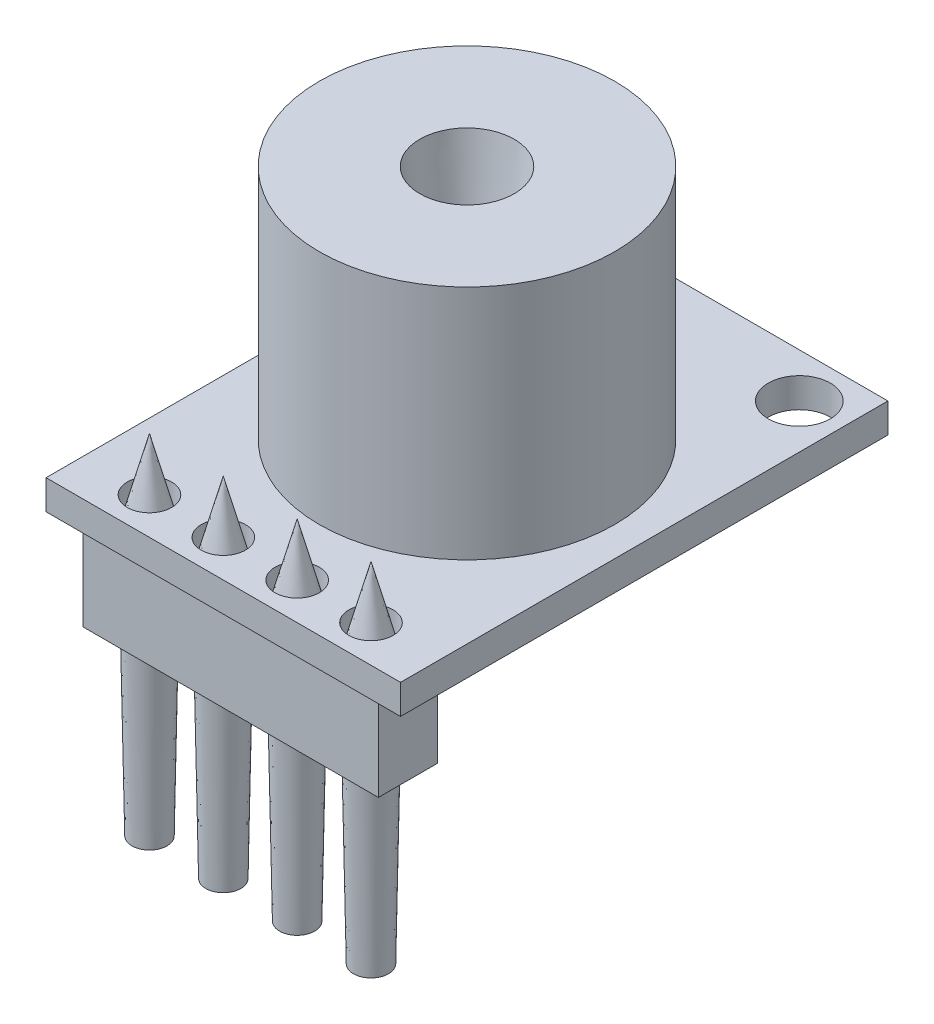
ISO-10303-21;
HEADER;
FILE_DESCRIPTION(('STEP AP214'),'2;1');
FILE_NAME('part.step','',(''),(''),'','','');
FILE_SCHEMA(('AUTOMOTIVE_DESIGN { 1 0 10303 214 1 1 1 1 }'));
ENDSEC;
DATA;
#1=APPLICATION_CONTEXT('core data for automotive mechanical design processes');
#2=APPLICATION_PROTOCOL_DEFINITION('international standard','automotive_design',2000,#1);
#3=PRODUCT_CONTEXT('',#1,'mechanical');
#4=PRODUCT('Part','Part','',(#3));
#5=PRODUCT_RELATED_PRODUCT_CATEGORY('part','',(#4));
#6=PRODUCT_DEFINITION_FORMATION('','',#4);
#7=PRODUCT_DEFINITION_CONTEXT('part definition',#1,'design');
#8=PRODUCT_DEFINITION('design','',#6,#7);
#9=PRODUCT_DEFINITION_SHAPE('','',#8);
#10=(LENGTH_UNIT() NAMED_UNIT(*) SI_UNIT(.MILLI.,.METRE.));
#11=(NAMED_UNIT(*) PLANE_ANGLE_UNIT() SI_UNIT($,.RADIAN.));
#12=(NAMED_UNIT(*) SI_UNIT($,.STERADIAN.) SOLID_ANGLE_UNIT());
#13=UNCERTAINTY_MEASURE_WITH_UNIT(LENGTH_MEASURE(1.E-05),#10,'distance_accuracy_value','');
#14=(GEOMETRIC_REPRESENTATION_CONTEXT(3) GLOBAL_UNCERTAINTY_ASSIGNED_CONTEXT((#13)) GLOBAL_UNIT_ASSIGNED_CONTEXT((#10,
#11,#12)) REPRESENTATION_CONTEXT('',''));
#15=CARTESIAN_POINT('',(0.,0.,0.));
#16=DIRECTION('',(0.,0.,1.));
#17=DIRECTION('',(1.,0.,0.));
#18=AXIS2_PLACEMENT_3D('',#15,#16,#17);
#19=CARTESIAN_POINT('',(3.75,0.,7.));
#20=DIRECTION('',(0.,1.,0.));
#21=DIRECTION('',(0.,0.,1.));
#22=AXIS2_PLACEMENT_3D('',#19,#20,#21);
#23=CONICAL_SURFACE('',#22,0.75,0.0174532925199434);
#24=CARTESIAN_POINT('',(3.75,-9.,7.));
#25=DIRECTION('',(0.,1.,0.));
#26=DIRECTION('',(0.,0.,1.));
#27=AXIS2_PLACEMENT_3D('',#24,#25,#26);
#28=CIRCLE('',#27,0.592904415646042);
#29=CARTESIAN_POINT('',(3.75,-9.,7.59290441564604));
#30=VERTEX_POINT('',#29);
#31=EDGE_CURVE('E55',#30,#30,#28,.T.);
#32=ORIENTED_EDGE('',*,*,#31,.T.);
#33=EDGE_LOOP('',(#32));
#34=FACE_BOUND('',#33,.T.);
#35=CARTESIAN_POINT('',(3.75,0.,7.));
#36=DIRECTION('',(0.,1.,0.));
#37=DIRECTION('',(0.,0.,1.));
#38=AXIS2_PLACEMENT_3D('',#35,#36,#37);
#39=CIRCLE('',#38,0.75);
#40=CARTESIAN_POINT('',(3.75,0.,7.75));
#41=VERTEX_POINT('',#40);
#42=EDGE_CURVE('E11',#41,#41,#39,.T.);
#43=ORIENTED_EDGE('',*,*,#42,.F.);
#44=EDGE_LOOP('',(#43));
#45=FACE_BOUND('',#44,.T.);
#46=ADVANCED_FACE('F48',(#34,#45),#23,.T.);
#47=CARTESIAN_POINT('',(3.75,-9.,7.));
#48=DIRECTION('',(0.,1.,0.));
#49=DIRECTION('',(0.,0.,1.));
#50=AXIS2_PLACEMENT_3D('',#47,#48,#49);
#51=PLANE('',#50);
#52=ORIENTED_EDGE('',*,*,#31,.F.);
#53=EDGE_LOOP('',(#52));
#54=FACE_BOUND('',#53,.T.);
#55=ADVANCED_FACE('F50',(#54),#51,.F.);
#56=CARTESIAN_POINT('',(3.75,0.,7.));
#57=DIRECTION('',(0.,1.,0.));
#58=DIRECTION('',(0.,0.,1.));
#59=AXIS2_PLACEMENT_3D('',#56,#57,#58);
#60=PLANE('',#59);
#61=ORIENTED_EDGE('',*,*,#42,.T.);
#62=EDGE_LOOP('',(#61));
#63=FACE_BOUND('',#62,.T.);
#64=ADVANCED_FACE('F64',(#63),#60,.T.);
#65=CLOSED_SHELL('',(#46,#55,#64));
#66=MANIFOLD_SOLID_BREP('B2',#65);
#67=CARTESIAN_POINT('',(1.25,0.,7.));
#68=DIRECTION('',(0.,1.,0.));
#69=DIRECTION('',(0.,0.,1.));
#70=AXIS2_PLACEMENT_3D('',#67,#68,#69);
#71=CONICAL_SURFACE('',#70,0.750000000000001,0.0174532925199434);
#72=CARTESIAN_POINT('',(1.25,-9.,7.));
#73=DIRECTION('',(0.,1.,0.));
#74=DIRECTION('',(0.,0.,1.));
#75=AXIS2_PLACEMENT_3D('',#72,#73,#74);
#76=CIRCLE('',#75,0.592904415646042);
#77=CARTESIAN_POINT('',(1.25,-9.,7.59290441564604));
#78=VERTEX_POINT('',#77);
#79=EDGE_CURVE('E110',#78,#78,#76,.T.);
#80=ORIENTED_EDGE('',*,*,#79,.T.);
#81=EDGE_LOOP('',(#80));
#82=FACE_BOUND('',#81,.T.);
#83=CARTESIAN_POINT('',(1.25,0.,7.));
#84=DIRECTION('',(0.,1.,0.));
#85=DIRECTION('',(0.,0.,1.));
#86=AXIS2_PLACEMENT_3D('',#83,#84,#85);
#87=CIRCLE('',#86,0.750000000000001);
#88=CARTESIAN_POINT('',(1.25,0.,7.75));
#89=VERTEX_POINT('',#88);
#90=EDGE_CURVE('E47',#89,#89,#87,.T.);
#91=ORIENTED_EDGE('',*,*,#90,.F.);
#92=EDGE_LOOP('',(#91));
#93=FACE_BOUND('',#92,.T.);
#94=ADVANCED_FACE('F103',(#82,#93),#71,.T.);
#95=CARTESIAN_POINT('',(1.25,-9.,7.));
#96=DIRECTION('',(0.,1.,0.));
#97=DIRECTION('',(0.,0.,1.));
#98=AXIS2_PLACEMENT_3D('',#95,#96,#97);
#99=PLANE('',#98);
#100=ORIENTED_EDGE('',*,*,#79,.F.);
#101=EDGE_LOOP('',(#100));
#102=FACE_BOUND('',#101,.T.);
#103=ADVANCED_FACE('F105',(#102),#99,.F.);
#104=CARTESIAN_POINT('',(1.25,0.,7.));
#105=DIRECTION('',(0.,1.,0.));
#106=DIRECTION('',(0.,0.,1.));
#107=AXIS2_PLACEMENT_3D('',#104,#105,#106);
#108=PLANE('',#107);
#109=ORIENTED_EDGE('',*,*,#90,.T.);
#110=EDGE_LOOP('',(#109));
#111=FACE_BOUND('',#110,.T.);
#112=ADVANCED_FACE('F119',(#111),#108,.T.);
#113=CLOSED_SHELL('',(#94,#103,#112));
#114=MANIFOLD_SOLID_BREP('B6',#113);
#115=CARTESIAN_POINT('',(-1.25,0.,7.));
#116=DIRECTION('',(0.,1.,0.));
#117=DIRECTION('',(0.,0.,1.));
#118=AXIS2_PLACEMENT_3D('',#115,#116,#117);
#119=CONICAL_SURFACE('',#118,0.750000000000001,0.0174532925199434);
#120=CARTESIAN_POINT('',(-1.25,-9.,7.));
#121=DIRECTION('',(0.,1.,0.));
#122=DIRECTION('',(0.,0.,1.));
#123=AXIS2_PLACEMENT_3D('',#120,#121,#122);
#124=CIRCLE('',#123,0.592904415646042);
#125=CARTESIAN_POINT('',(-1.25,-9.,7.59290441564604));
#126=VERTEX_POINT('',#125);
#127=EDGE_CURVE('E165',#126,#126,#124,.T.);
#128=ORIENTED_EDGE('',*,*,#127,.T.);
#129=EDGE_LOOP('',(#128));
#130=FACE_BOUND('',#129,.T.);
#131=CARTESIAN_POINT('',(-1.25,0.,7.));
#132=DIRECTION('',(0.,1.,0.));
#133=DIRECTION('',(0.,0.,1.));
#134=AXIS2_PLACEMENT_3D('',#131,#132,#133);
#135=CIRCLE('',#134,0.750000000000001);
#136=CARTESIAN_POINT('',(-1.25,0.,7.75));
#137=VERTEX_POINT('',#136);
#138=EDGE_CURVE('E102',#137,#137,#135,.T.);
#139=ORIENTED_EDGE('',*,*,#138,.F.);
#140=EDGE_LOOP('',(#139));
#141=FACE_BOUND('',#140,.T.);
#142=ADVANCED_FACE('F158',(#130,#141),#119,.T.);
#143=CARTESIAN_POINT('',(-1.25,-9.,7.));
#144=DIRECTION('',(0.,1.,0.));
#145=DIRECTION('',(0.,0.,1.));
#146=AXIS2_PLACEMENT_3D('',#143,#144,#145);
#147=PLANE('',#146);
#148=ORIENTED_EDGE('',*,*,#127,.F.);
#149=EDGE_LOOP('',(#148));
#150=FACE_BOUND('',#149,.T.);
#151=ADVANCED_FACE('F160',(#150),#147,.F.);
#152=CARTESIAN_POINT('',(-1.25,0.,7.));
#153=DIRECTION('',(0.,1.,0.));
#154=DIRECTION('',(0.,0.,1.));
#155=AXIS2_PLACEMENT_3D('',#152,#153,#154);
#156=PLANE('',#155);
#157=ORIENTED_EDGE('',*,*,#138,.T.);
#158=EDGE_LOOP('',(#157));
#159=FACE_BOUND('',#158,.T.);
#160=ADVANCED_FACE('F174',(#159),#156,.T.);
#161=CLOSED_SHELL('',(#142,#151,#160));
#162=MANIFOLD_SOLID_BREP('B42',#161);
#163=CARTESIAN_POINT('',(-3.75,0.,7.));
#164=DIRECTION('',(0.,1.,0.));
#165=DIRECTION('',(0.,0.,1.));
#166=AXIS2_PLACEMENT_3D('',#163,#164,#165);
#167=CONICAL_SURFACE('',#166,0.750000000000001,0.0174532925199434);
#168=CARTESIAN_POINT('',(-3.75,-9.,7.));
#169=DIRECTION('',(0.,1.,0.));
#170=DIRECTION('',(0.,0.,1.));
#171=AXIS2_PLACEMENT_3D('',#168,#169,#170);
#172=CIRCLE('',#171,0.592904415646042);
#173=CARTESIAN_POINT('',(-3.75,-9.,7.59290441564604));
#174=VERTEX_POINT('',#173);
#175=EDGE_CURVE('E157',#174,#174,#172,.T.);
#176=ORIENTED_EDGE('',*,*,#175,.T.);
#177=EDGE_LOOP('',(#176));
#178=FACE_BOUND('',#177,.T.);
#179=CARTESIAN_POINT('',(-3.75,0.,7.));
#180=DIRECTION('',(0.,1.,0.));
#181=DIRECTION('',(0.,0.,1.));
#182=AXIS2_PLACEMENT_3D('',#179,#180,#181);
#183=CIRCLE('',#182,0.750000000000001);
#184=CARTESIAN_POINT('',(-3.75,0.,7.75));
#185=VERTEX_POINT('',#184);
#186=EDGE_CURVE('E221',#185,#185,#183,.T.);
#187=ORIENTED_EDGE('',*,*,#186,.F.);
#188=EDGE_LOOP('',(#187));
#189=FACE_BOUND('',#188,.T.);
#190=ADVANCED_FACE('F215',(#178,#189),#167,.T.);
#191=CARTESIAN_POINT('',(-3.75,-9.,7.));
#192=DIRECTION('',(0.,1.,0.));
#193=DIRECTION('',(0.,0.,1.));
#194=AXIS2_PLACEMENT_3D('',#191,#192,#193);
#195=PLANE('',#194);
#196=ORIENTED_EDGE('',*,*,#175,.F.);
#197=EDGE_LOOP('',(#196));
#198=FACE_BOUND('',#197,.T.);
#199=ADVANCED_FACE('F230',(#198),#195,.F.);
#200=CARTESIAN_POINT('',(-3.75,0.,7.));
#201=DIRECTION('',(0.,1.,0.));
#202=DIRECTION('',(0.,0.,1.));
#203=AXIS2_PLACEMENT_3D('',#200,#201,#202);
#204=PLANE('',#203);
#205=ORIENTED_EDGE('',*,*,#186,.T.);
#206=EDGE_LOOP('',(#205));
#207=FACE_BOUND('',#206,.T.);
#208=ADVANCED_FACE('F227',(#207),#204,.T.);
#209=CLOSED_SHELL('',(#190,#199,#208));
#210=MANIFOLD_SOLID_BREP('B97',#209);
#211=CARTESIAN_POINT('',(5.,-3.,6.));
#212=DIRECTION('',(1.,0.,0.));
#213=DIRECTION('',(0.,0.,-1.));
#214=AXIS2_PLACEMENT_3D('',#211,#212,#213);
#215=PLANE('',#214);
#216=DIRECTION('',(0.,0.,-1.));
#217=VECTOR('',#216,1.);
#218=CARTESIAN_POINT('',(5.,0.,6.));
#219=LINE('',#218,#217);
#220=CARTESIAN_POINT('',(5.,0.,8.));
#221=VERTEX_POINT('',#220);
#222=CARTESIAN_POINT('',(5.,0.,6.));
#223=VERTEX_POINT('',#222);
#224=EDGE_CURVE('E336',#221,#223,#219,.T.);
#225=ORIENTED_EDGE('',*,*,#224,.F.);
#226=DIRECTION('',(0.,1.,0.));
#227=VECTOR('',#226,1.);
#228=CARTESIAN_POINT('',(5.,-3.,8.));
#229=LINE('',#228,#227);
#230=CARTESIAN_POINT('',(5.,-3.,8.));
#231=VERTEX_POINT('',#230);
#232=EDGE_CURVE('E213',#231,#221,#229,.T.);
#233=ORIENTED_EDGE('',*,*,#232,.F.);
#234=DIRECTION('',(0.,0.,-1.));
#235=VECTOR('',#234,1.);
#236=CARTESIAN_POINT('',(5.,-3.,6.));
#237=LINE('',#236,#235);
#238=CARTESIAN_POINT('',(5.,-3.,6.));
#239=VERTEX_POINT('',#238);
#240=EDGE_CURVE('E330',#231,#239,#237,.T.);
#241=ORIENTED_EDGE('',*,*,#240,.T.);
#242=DIRECTION('',(0.,1.,0.));
#243=VECTOR('',#242,1.);
#244=CARTESIAN_POINT('',(5.,-3.,6.));
#245=LINE('',#244,#243);
#246=EDGE_CURVE('E275',#239,#223,#245,.T.);
#247=ORIENTED_EDGE('',*,*,#246,.T.);
#248=EDGE_LOOP('',(#225,#233,#241,#247));
#249=FACE_BOUND('',#248,.T.);
#250=ADVANCED_FACE('F272',(#249),#215,.T.);
#251=CARTESIAN_POINT('',(-5.,-3.,8.));
#252=DIRECTION('',(0.,0.,1.));
#253=DIRECTION('',(1.,0.,0.));
#254=AXIS2_PLACEMENT_3D('',#251,#252,#253);
#255=PLANE('',#254);
#256=DIRECTION('',(1.,0.,0.));
#257=VECTOR('',#256,1.);
#258=CARTESIAN_POINT('',(-5.,0.,8.));
#259=LINE('',#258,#257);
#260=CARTESIAN_POINT('',(-5.,0.,8.));
#261=VERTEX_POINT('',#260);
#262=EDGE_CURVE('E332',#261,#221,#259,.T.);
#263=ORIENTED_EDGE('',*,*,#262,.F.);
#264=DIRECTION('',(0.,1.,0.));
#265=VECTOR('',#264,1.);
#266=CARTESIAN_POINT('',(-5.,-3.,8.));
#267=LINE('',#266,#265);
#268=CARTESIAN_POINT('',(-5.,-3.,8.));
#269=VERTEX_POINT('',#268);
#270=EDGE_CURVE('E281',#269,#261,#267,.T.);
#271=ORIENTED_EDGE('',*,*,#270,.F.);
#272=DIRECTION('',(1.,0.,0.));
#273=VECTOR('',#272,1.);
#274=CARTESIAN_POINT('',(-5.,-3.,8.));
#275=LINE('',#274,#273);
#276=EDGE_CURVE('E327',#269,#231,#275,.T.);
#277=ORIENTED_EDGE('',*,*,#276,.T.);
#278=ORIENTED_EDGE('',*,*,#232,.T.);
#279=EDGE_LOOP('',(#263,#271,#277,#278));
#280=FACE_BOUND('',#279,.T.);
#281=ADVANCED_FACE('F346',(#280),#255,.T.);
#282=CARTESIAN_POINT('',(-5.,-3.,6.));
#283=DIRECTION('',(-1.,0.,0.));
#284=DIRECTION('',(0.,0.,1.));
#285=AXIS2_PLACEMENT_3D('',#282,#283,#284);
#286=PLANE('',#285);
#287=DIRECTION('',(0.,0.,1.));
#288=VECTOR('',#287,1.);
#289=CARTESIAN_POINT('',(-5.,0.,6.));
#290=LINE('',#289,#288);
#291=CARTESIAN_POINT('',(-5.,0.,6.));
#292=VERTEX_POINT('',#291);
#293=EDGE_CURVE('E322',#292,#261,#290,.T.);
#294=ORIENTED_EDGE('',*,*,#293,.F.);
#295=DIRECTION('',(0.,1.,0.));
#296=VECTOR('',#295,1.);
#297=CARTESIAN_POINT('',(-5.,-3.,6.));
#298=LINE('',#297,#296);
#299=CARTESIAN_POINT('',(-5.,-3.,6.));
#300=VERTEX_POINT('',#299);
#301=EDGE_CURVE('E317',#300,#292,#298,.T.);
#302=ORIENTED_EDGE('',*,*,#301,.F.);
#303=DIRECTION('',(0.,0.,1.));
#304=VECTOR('',#303,1.);
#305=CARTESIAN_POINT('',(-5.,-3.,6.));
#306=LINE('',#305,#304);
#307=EDGE_CURVE('E320',#300,#269,#306,.T.);
#308=ORIENTED_EDGE('',*,*,#307,.T.);
#309=ORIENTED_EDGE('',*,*,#270,.T.);
#310=EDGE_LOOP('',(#294,#302,#308,#309));
#311=FACE_BOUND('',#310,.T.);
#312=ADVANCED_FACE('F319',(#311),#286,.T.);
#313=CARTESIAN_POINT('',(-5.,-3.,6.));
#314=DIRECTION('',(0.,0.,-1.));
#315=DIRECTION('',(-1.,0.,0.));
#316=AXIS2_PLACEMENT_3D('',#313,#314,#315);
#317=PLANE('',#316);
#318=DIRECTION('',(-1.,0.,0.));
#319=VECTOR('',#318,1.);
#320=CARTESIAN_POINT('',(-5.,0.,6.));
#321=LINE('',#320,#319);
#322=EDGE_CURVE('E339',#223,#292,#321,.T.);
#323=ORIENTED_EDGE('',*,*,#322,.F.);
#324=ORIENTED_EDGE('',*,*,#246,.F.);
#325=DIRECTION('',(-1.,0.,0.));
#326=VECTOR('',#325,1.);
#327=CARTESIAN_POINT('',(-5.,-3.,6.));
#328=LINE('',#327,#326);
#329=EDGE_CURVE('E326',#239,#300,#328,.T.);
#330=ORIENTED_EDGE('',*,*,#329,.T.);
#331=ORIENTED_EDGE('',*,*,#301,.T.);
#332=EDGE_LOOP('',(#323,#324,#330,#331));
#333=FACE_BOUND('',#332,.T.);
#334=ADVANCED_FACE('F329',(#333),#317,.T.);
#335=CARTESIAN_POINT('',(0.,-3.,0.));
#336=DIRECTION('',(0.,1.,0.));
#337=DIRECTION('',(0.,0.,1.));
#338=AXIS2_PLACEMENT_3D('',#335,#336,#337);
#339=PLANE('',#338);
#340=ORIENTED_EDGE('',*,*,#240,.F.);
#341=ORIENTED_EDGE('',*,*,#276,.F.);
#342=ORIENTED_EDGE('',*,*,#307,.F.);
#343=ORIENTED_EDGE('',*,*,#329,.F.);
#344=EDGE_LOOP('',(#340,#341,#342,#343));
#345=FACE_BOUND('',#344,.T.);
#346=ADVANCED_FACE('F325',(#345),#339,.F.);
#347=CARTESIAN_POINT('',(0.,0.,0.));
#348=DIRECTION('',(0.,1.,0.));
#349=DIRECTION('',(0.,0.,1.));
#350=AXIS2_PLACEMENT_3D('',#347,#348,#349);
#351=PLANE('',#350);
#352=ORIENTED_EDGE('',*,*,#224,.T.);
#353=ORIENTED_EDGE('',*,*,#322,.T.);
#354=ORIENTED_EDGE('',*,*,#293,.T.);
#355=ORIENTED_EDGE('',*,*,#262,.T.);
#356=EDGE_LOOP('',(#352,#353,#354,#355));
#357=FACE_BOUND('',#356,.T.);
#358=ADVANCED_FACE('F345',(#357),#351,.T.);
#359=CLOSED_SHELL('',(#250,#281,#312,#334,#346,#358));
#360=MANIFOLD_SOLID_BREP('B152',#359);
#361=CARTESIAN_POINT('',(3.75,0.,7.));
#362=DIRECTION('',(0.,-1.,0.));
#363=DIRECTION('',(0.,0.,1.));
#364=AXIS2_PLACEMENT_3D('',#361,#362,#363);
#365=CONICAL_SURFACE('',#364,0.75,0.261799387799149);
#366=CARTESIAN_POINT('',(3.75,2.79903810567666,7.));
#367=VERTEX_POINT('',#366);
#368=VERTEX_LOOP('',#367);
#369=FACE_BOUND('',#368,.T.);
#370=CARTESIAN_POINT('',(3.75,0.,7.));
#371=DIRECTION('',(0.,1.,0.));
#372=DIRECTION('',(0.,0.,1.));
#373=AXIS2_PLACEMENT_3D('',#370,#371,#372);
#374=CIRCLE('',#373,0.75);
#375=CARTESIAN_POINT('',(3.75,0.,7.75));
#376=VERTEX_POINT('',#375);
#377=EDGE_CURVE('E270',#376,#376,#374,.T.);
#378=ORIENTED_EDGE('',*,*,#377,.T.);
#379=EDGE_LOOP('',(#378));
#380=FACE_BOUND('',#379,.T.);
#381=ADVANCED_FACE('F418',(#369,#380),#365,.T.);
#382=CARTESIAN_POINT('',(3.75,0.,7.));
#383=DIRECTION('',(0.,1.,0.));
#384=DIRECTION('',(0.,0.,1.));
#385=AXIS2_PLACEMENT_3D('',#382,#383,#384);
#386=PLANE('',#385);
#387=ORIENTED_EDGE('',*,*,#377,.F.);
#388=EDGE_LOOP('',(#387));
#389=FACE_BOUND('',#388,.T.);
#390=ADVANCED_FACE('F420',(#389),#386,.F.);
#391=CLOSED_SHELL('',(#381,#390));
#392=MANIFOLD_SOLID_BREP('B207',#391);
#393=CARTESIAN_POINT('',(1.25,0.,7.));
#394=DIRECTION('',(0.,-1.,0.));
#395=DIRECTION('',(0.,0.,1.));
#396=AXIS2_PLACEMENT_3D('',#393,#394,#395);
#397=CONICAL_SURFACE('',#396,0.750000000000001,0.261799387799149);
#398=CARTESIAN_POINT('',(1.25,2.79903810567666,7.));
#399=VERTEX_POINT('',#398);
#400=VERTEX_LOOP('',#399);
#401=FACE_BOUND('',#400,.T.);
#402=CARTESIAN_POINT('',(1.25,0.,7.));
#403=DIRECTION('',(0.,1.,0.));
#404=DIRECTION('',(0.,0.,1.));
#405=AXIS2_PLACEMENT_3D('',#402,#403,#404);
#406=CIRCLE('',#405,0.750000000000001);
#407=CARTESIAN_POINT('',(1.25,0.,7.75));
#408=VERTEX_POINT('',#407);
#409=EDGE_CURVE('E416',#408,#408,#406,.T.);
#410=ORIENTED_EDGE('',*,*,#409,.T.);
#411=EDGE_LOOP('',(#410));
#412=FACE_BOUND('',#411,.T.);
#413=ADVANCED_FACE('F460',(#401,#412),#397,.T.);
#414=CARTESIAN_POINT('',(1.25,0.,7.));
#415=DIRECTION('',(0.,1.,0.));
#416=DIRECTION('',(0.,0.,1.));
#417=AXIS2_PLACEMENT_3D('',#414,#415,#416);
#418=PLANE('',#417);
#419=ORIENTED_EDGE('',*,*,#409,.F.);
#420=EDGE_LOOP('',(#419));
#421=FACE_BOUND('',#420,.T.);
#422=ADVANCED_FACE('F462',(#421),#418,.F.);
#423=CLOSED_SHELL('',(#413,#422));
#424=MANIFOLD_SOLID_BREP('B264',#423);
#425=CARTESIAN_POINT('',(-1.25,0.,7.));
#426=DIRECTION('',(0.,-1.,0.));
#427=DIRECTION('',(0.,0.,1.));
#428=AXIS2_PLACEMENT_3D('',#425,#426,#427);
#429=CONICAL_SURFACE('',#428,0.750000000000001,0.261799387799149);
#430=CARTESIAN_POINT('',(-1.25,2.79903810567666,7.));
#431=VERTEX_POINT('',#430);
#432=VERTEX_LOOP('',#431);
#433=FACE_BOUND('',#432,.T.);
#434=CARTESIAN_POINT('',(-1.25,0.,7.));
#435=DIRECTION('',(0.,1.,0.));
#436=DIRECTION('',(0.,0.,1.));
#437=AXIS2_PLACEMENT_3D('',#434,#435,#436);
#438=CIRCLE('',#437,0.750000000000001);
#439=CARTESIAN_POINT('',(-1.25,0.,7.75));
#440=VERTEX_POINT('',#439);
#441=EDGE_CURVE('E458',#440,#440,#438,.T.);
#442=ORIENTED_EDGE('',*,*,#441,.T.);
#443=EDGE_LOOP('',(#442));
#444=FACE_BOUND('',#443,.T.);
#445=ADVANCED_FACE('F502',(#433,#444),#429,.T.);
#446=CARTESIAN_POINT('',(-1.25,0.,7.));
#447=DIRECTION('',(0.,1.,0.));
#448=DIRECTION('',(0.,0.,1.));
#449=AXIS2_PLACEMENT_3D('',#446,#447,#448);
#450=PLANE('',#449);
#451=ORIENTED_EDGE('',*,*,#441,.F.);
#452=EDGE_LOOP('',(#451));
#453=FACE_BOUND('',#452,.T.);
#454=ADVANCED_FACE('F504',(#453),#450,.F.);
#455=CLOSED_SHELL('',(#445,#454));
#456=MANIFOLD_SOLID_BREP('B410',#455);
#457=CARTESIAN_POINT('',(-3.75,0.,7.));
#458=DIRECTION('',(0.,-1.,0.));
#459=DIRECTION('',(0.,0.,1.));
#460=AXIS2_PLACEMENT_3D('',#457,#458,#459);
#461=CONICAL_SURFACE('',#460,0.750000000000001,0.261799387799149);
#462=CARTESIAN_POINT('',(-3.75,2.79903810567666,7.));
#463=VERTEX_POINT('',#462);
#464=VERTEX_LOOP('',#463);
#465=FACE_BOUND('',#464,.T.);
#466=CARTESIAN_POINT('',(-3.75,0.,7.));
#467=DIRECTION('',(0.,1.,0.));
#468=DIRECTION('',(0.,0.,1.));
#469=AXIS2_PLACEMENT_3D('',#466,#467,#468);
#470=CIRCLE('',#469,0.750000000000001);
#471=CARTESIAN_POINT('',(-3.75,0.,7.75));
#472=VERTEX_POINT('',#471);
#473=EDGE_CURVE('E500',#472,#472,#470,.T.);
#474=ORIENTED_EDGE('',*,*,#473,.T.);
#475=EDGE_LOOP('',(#474));
#476=FACE_BOUND('',#475,.T.);
#477=ADVANCED_FACE('F542',(#465,#476),#461,.T.);
#478=CARTESIAN_POINT('',(-3.75,0.,7.));
#479=DIRECTION('',(0.,1.,0.));
#480=DIRECTION('',(0.,0.,1.));
#481=AXIS2_PLACEMENT_3D('',#478,#479,#480);
#482=PLANE('',#481);
#483=ORIENTED_EDGE('',*,*,#473,.F.);
#484=EDGE_LOOP('',(#483));
#485=FACE_BOUND('',#484,.T.);
#486=ADVANCED_FACE('F551',(#485),#482,.F.);
#487=CLOSED_SHELL('',(#477,#486));
#488=MANIFOLD_SOLID_BREP('B452',#487);
#489=CARTESIAN_POINT('',(0.,9.,0.));
#490=DIRECTION('',(0.,-1.,0.));
#491=DIRECTION('',(0.,0.,-1.));
#492=AXIS2_PLACEMENT_3D('',#489,#490,#491);
#493=CYLINDRICAL_SURFACE('',#492,5.);
#494=CARTESIAN_POINT('',(0.,9.,0.));
#495=DIRECTION('',(0.,1.,0.));
#496=DIRECTION('',(0.,0.,1.));
#497=AXIS2_PLACEMENT_3D('',#494,#495,#496);
#498=CIRCLE('',#497,5.);
#499=CARTESIAN_POINT('',(0.,9.,5.));
#500=VERTEX_POINT('',#499);
#501=EDGE_CURVE('E541',#500,#500,#498,.T.);
#502=ORIENTED_EDGE('',*,*,#501,.F.);
#503=EDGE_LOOP('',(#502));
#504=FACE_BOUND('',#503,.T.);
#505=CARTESIAN_POINT('',(0.,1.,0.));
#506=DIRECTION('',(0.,1.,0.));
#507=DIRECTION('',(0.,0.,1.));
#508=AXIS2_PLACEMENT_3D('',#505,#506,#507);
#509=CIRCLE('',#508,5.);
#510=CARTESIAN_POINT('',(0.,1.,5.));
#511=VERTEX_POINT('',#510);
#512=EDGE_CURVE('E586',#511,#511,#509,.T.);
#513=ORIENTED_EDGE('',*,*,#512,.T.);
#514=EDGE_LOOP('',(#513));
#515=FACE_BOUND('',#514,.T.);
#516=ADVANCED_FACE('F583',(#504,#515),#493,.T.);
#517=CARTESIAN_POINT('',(0.,9.,0.));
#518=DIRECTION('',(0.,1.,0.));
#519=DIRECTION('',(0.,0.,1.));
#520=AXIS2_PLACEMENT_3D('',#517,#518,#519);
#521=PLANE('',#520);
#522=CARTESIAN_POINT('',(0.,9.,0.));
#523=DIRECTION('',(0.,1.,0.));
#524=DIRECTION('',(0.,0.,1.));
#525=AXIS2_PLACEMENT_3D('',#522,#523,#524);
#526=CIRCLE('',#525,1.59896337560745);
#527=CARTESIAN_POINT('',(0.,9.,1.59896337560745));
#528=VERTEX_POINT('',#527);
#529=EDGE_CURVE('E597',#528,#528,#526,.T.);
#530=ORIENTED_EDGE('',*,*,#529,.F.);
#531=EDGE_LOOP('',(#530));
#532=FACE_BOUND('',#531,.T.);
#533=ORIENTED_EDGE('',*,*,#501,.T.);
#534=EDGE_LOOP('',(#533));
#535=FACE_BOUND('',#534,.T.);
#536=ADVANCED_FACE('F603',(#532,#535),#521,.T.);
#537=CARTESIAN_POINT('',(0.,1.,0.));
#538=DIRECTION('',(0.,1.,0.));
#539=DIRECTION('',(0.,0.,1.));
#540=AXIS2_PLACEMENT_3D('',#537,#538,#539);
#541=PLANE('',#540);
#542=ORIENTED_EDGE('',*,*,#512,.F.);
#543=EDGE_LOOP('',(#542));
#544=FACE_BOUND('',#543,.T.);
#545=ADVANCED_FACE('F605',(#544),#541,.F.);
#546=CARTESIAN_POINT('',(0.,9.,0.));
#547=DIRECTION('',(0.,1.,0.));
#548=DIRECTION('',(0.,0.,1.));
#549=AXIS2_PLACEMENT_3D('',#546,#547,#548);
#550=CONICAL_SURFACE('',#549,1.59896337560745,0.139626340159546);
#551=CARTESIAN_POINT('',(0.,5.,0.));
#552=DIRECTION('',(0.,1.,0.));
#553=DIRECTION('',(0.,0.,1.));
#554=AXIS2_PLACEMENT_3D('',#551,#552,#553);
#555=CIRCLE('',#554,1.03680003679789);
#556=CARTESIAN_POINT('',(0.,5.,1.03680003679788));
#557=VERTEX_POINT('',#556);
#558=EDGE_CURVE('E593',#557,#557,#555,.T.);
#559=ORIENTED_EDGE('',*,*,#558,.F.);
#560=EDGE_LOOP('',(#559));
#561=FACE_BOUND('',#560,.T.);
#562=ORIENTED_EDGE('',*,*,#529,.T.);
#563=EDGE_LOOP('',(#562));
#564=FACE_BOUND('',#563,.T.);
#565=ADVANCED_FACE('F601',(#561,#564),#550,.F.);
#566=CARTESIAN_POINT('',(0.,5.,0.));
#567=DIRECTION('',(0.,1.,0.));
#568=DIRECTION('',(0.,0.,1.));
#569=AXIS2_PLACEMENT_3D('',#566,#567,#568);
#570=PLANE('',#569);
#571=ORIENTED_EDGE('',*,*,#558,.T.);
#572=EDGE_LOOP('',(#571));
#573=FACE_BOUND('',#572,.T.);
#574=ADVANCED_FACE('F616',(#573),#570,.T.);
#575=CLOSED_SHELL('',(#516,#536,#545,#565,#574));
#576=MANIFOLD_SOLID_BREP('B494',#575);
#577=CARTESIAN_POINT('',(6.,1.,0.));
#578=DIRECTION('',(1.,0.,0.));
#579=DIRECTION('',(0.,0.,-1.));
#580=AXIS2_PLACEMENT_3D('',#577,#578,#579);
#581=PLANE('',#580);
#582=DIRECTION('',(0.,0.,1.));
#583=VECTOR('',#582,1.);
#584=CARTESIAN_POINT('',(6.,0.,0.));
#585=LINE('',#584,#583);
#586=CARTESIAN_POINT('',(6.,0.,-8.25));
#587=VERTEX_POINT('',#586);
#588=CARTESIAN_POINT('',(6.,0.,8.25));
#589=VERTEX_POINT('',#588);
#590=EDGE_CURVE('E750',#587,#589,#585,.T.);
#591=ORIENTED_EDGE('',*,*,#590,.F.);
#592=DIRECTION('',(0.,-1.,0.));
#593=VECTOR('',#592,1.);
#594=CARTESIAN_POINT('',(6.,1.,-8.25));
#595=LINE('',#594,#593);
#596=CARTESIAN_POINT('',(6.,1.,-8.25));
#597=VERTEX_POINT('',#596);
#598=EDGE_CURVE('E581',#597,#587,#595,.T.);
#599=ORIENTED_EDGE('',*,*,#598,.F.);
#600=DIRECTION('',(0.,0.,1.));
#601=VECTOR('',#600,1.);
#602=CARTESIAN_POINT('',(6.,1.,0.));
#603=LINE('',#602,#601);
#604=CARTESIAN_POINT('',(6.,1.,8.25));
#605=VERTEX_POINT('',#604);
#606=EDGE_CURVE('E725',#597,#605,#603,.T.);
#607=ORIENTED_EDGE('',*,*,#606,.T.);
#608=DIRECTION('',(0.,-1.,0.));
#609=VECTOR('',#608,1.);
#610=CARTESIAN_POINT('',(6.,1.,8.25));
#611=LINE('',#610,#609);
#612=EDGE_CURVE('E704',#605,#589,#611,.T.);
#613=ORIENTED_EDGE('',*,*,#612,.T.);
#614=EDGE_LOOP('',(#591,#599,#607,#613));
#615=FACE_BOUND('',#614,.T.);
#616=ADVANCED_FACE('F664',(#615),#581,.T.);
#617=CARTESIAN_POINT('',(0.,1.,-8.25));
#618=DIRECTION('',(0.,0.,-1.));
#619=DIRECTION('',(-1.,0.,0.));
#620=AXIS2_PLACEMENT_3D('',#617,#618,#619);
#621=PLANE('',#620);
#622=DIRECTION('',(1.,0.,0.));
#623=VECTOR('',#622,1.);
#624=CARTESIAN_POINT('',(0.,0.,-8.25));
#625=LINE('',#624,#623);
#626=CARTESIAN_POINT('',(-6.,0.,-8.25));
#627=VERTEX_POINT('',#626);
#628=EDGE_CURVE('E716',#627,#587,#625,.T.);
#629=ORIENTED_EDGE('',*,*,#628,.F.);
#630=DIRECTION('',(0.,-1.,0.));
#631=VECTOR('',#630,1.);
#632=CARTESIAN_POINT('',(-6.,1.,-8.25));
#633=LINE('',#632,#631);
#634=CARTESIAN_POINT('',(-6.,1.,-8.25));
#635=VERTEX_POINT('',#634);
#636=EDGE_CURVE('E673',#635,#627,#633,.T.);
#637=ORIENTED_EDGE('',*,*,#636,.F.);
#638=DIRECTION('',(1.,0.,0.));
#639=VECTOR('',#638,1.);
#640=CARTESIAN_POINT('',(0.,1.,-8.25));
#641=LINE('',#640,#639);
#642=EDGE_CURVE('E714',#635,#597,#641,.T.);
#643=ORIENTED_EDGE('',*,*,#642,.T.);
#644=ORIENTED_EDGE('',*,*,#598,.T.);
#645=EDGE_LOOP('',(#629,#637,#643,#644));
#646=FACE_BOUND('',#645,.T.);
#647=ADVANCED_FACE('F712',(#646),#621,.T.);
#648=CARTESIAN_POINT('',(-6.,1.,0.));
#649=DIRECTION('',(1.,0.,0.));
#650=DIRECTION('',(0.,0.,-1.));
#651=AXIS2_PLACEMENT_3D('',#648,#649,#650);
#652=PLANE('',#651);
#653=DIRECTION('',(0.,0.,1.));
#654=VECTOR('',#653,1.);
#655=CARTESIAN_POINT('',(-6.,0.,0.));
#656=LINE('',#655,#654);
#657=CARTESIAN_POINT('',(-6.,0.,8.25));
#658=VERTEX_POINT('',#657);
#659=EDGE_CURVE('E753',#627,#658,#656,.T.);
#660=ORIENTED_EDGE('',*,*,#659,.T.);
#661=DIRECTION('',(0.,-1.,0.));
#662=VECTOR('',#661,1.);
#663=CARTESIAN_POINT('',(-6.,1.,8.25));
#664=LINE('',#663,#662);
#665=CARTESIAN_POINT('',(-6.,1.,8.25));
#666=VERTEX_POINT('',#665);
#667=EDGE_CURVE('E719',#666,#658,#664,.T.);
#668=ORIENTED_EDGE('',*,*,#667,.F.);
#669=DIRECTION('',(0.,0.,1.));
#670=VECTOR('',#669,1.);
#671=CARTESIAN_POINT('',(-6.,1.,0.));
#672=LINE('',#671,#670);
#673=EDGE_CURVE('E721',#635,#666,#672,.T.);
#674=ORIENTED_EDGE('',*,*,#673,.F.);
#675=ORIENTED_EDGE('',*,*,#636,.T.);
#676=EDGE_LOOP('',(#660,#668,#674,#675));
#677=FACE_BOUND('',#676,.T.);
#678=ADVANCED_FACE('F722',(#677),#652,.F.);
#679=CARTESIAN_POINT('',(-3.75,1.,7.));
#680=DIRECTION('',(0.,-1.,0.));
#681=DIRECTION('',(0.,0.,-1.));
#682=AXIS2_PLACEMENT_3D('',#679,#680,#681);
#683=CYLINDRICAL_SURFACE('',#682,0.750000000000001);
#684=CARTESIAN_POINT('',(-3.75,1.,7.));
#685=DIRECTION('',(0.,1.,0.));
#686=DIRECTION('',(0.,0.,1.));
#687=AXIS2_PLACEMENT_3D('',#684,#685,#686);
#688=CIRCLE('',#687,0.750000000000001);
#689=CARTESIAN_POINT('',(-3.75,1.,7.75));
#690=VERTEX_POINT('',#689);
#691=EDGE_CURVE('E727',#690,#690,#688,.T.);
#692=ORIENTED_EDGE('',*,*,#691,.T.);
#693=EDGE_LOOP('',(#692));
#694=FACE_BOUND('',#693,.T.);
#695=CARTESIAN_POINT('',(-3.75,0.,7.));
#696=DIRECTION('',(0.,1.,0.));
#697=DIRECTION('',(0.,0.,1.));
#698=AXIS2_PLACEMENT_3D('',#695,#696,#697);
#699=CIRCLE('',#698,0.750000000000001);
#700=CARTESIAN_POINT('',(-3.75,0.,7.75));
#701=VERTEX_POINT('',#700);
#702=EDGE_CURVE('E747',#701,#701,#699,.T.);
#703=ORIENTED_EDGE('',*,*,#702,.F.);
#704=EDGE_LOOP('',(#703));
#705=FACE_BOUND('',#704,.T.);
#706=ADVANCED_FACE('F769',(#694,#705),#683,.F.);
#707=CARTESIAN_POINT('',(-1.25,1.,7.));
#708=DIRECTION('',(0.,-1.,0.));
#709=DIRECTION('',(0.,0.,-1.));
#710=AXIS2_PLACEMENT_3D('',#707,#708,#709);
#711=CYLINDRICAL_SURFACE('',#710,0.750000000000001);
#712=CARTESIAN_POINT('',(-1.25,1.,7.));
#713=DIRECTION('',(0.,1.,0.));
#714=DIRECTION('',(0.,0.,1.));
#715=AXIS2_PLACEMENT_3D('',#712,#713,#714);
#716=CIRCLE('',#715,0.750000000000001);
#717=CARTESIAN_POINT('',(-1.25,1.,7.75));
#718=VERTEX_POINT('',#717);
#719=EDGE_CURVE('E927',#718,#718,#716,.T.);
#720=ORIENTED_EDGE('',*,*,#719,.T.);
#721=EDGE_LOOP('',(#720));
#722=FACE_BOUND('',#721,.T.);
#723=CARTESIAN_POINT('',(-1.25,0.,7.));
#724=DIRECTION('',(0.,1.,0.));
#725=DIRECTION('',(0.,0.,1.));
#726=AXIS2_PLACEMENT_3D('',#723,#724,#725);
#727=CIRCLE('',#726,0.750000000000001);
#728=CARTESIAN_POINT('',(-1.25,0.,7.75));
#729=VERTEX_POINT('',#728);
#730=EDGE_CURVE('E744',#729,#729,#727,.T.);
#731=ORIENTED_EDGE('',*,*,#730,.F.);
#732=EDGE_LOOP('',(#731));
#733=FACE_BOUND('',#732,.T.);
#734=ADVANCED_FACE('F772',(#722,#733),#711,.F.);
#735=CARTESIAN_POINT('',(1.25,1.,7.));
#736=DIRECTION('',(0.,-1.,0.));
#737=DIRECTION('',(0.,0.,-1.));
#738=AXIS2_PLACEMENT_3D('',#735,#736,#737);
#739=CYLINDRICAL_SURFACE('',#738,0.750000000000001);
#740=CARTESIAN_POINT('',(1.25,1.,7.));
#741=DIRECTION('',(0.,1.,0.));
#742=DIRECTION('',(0.,0.,1.));
#743=AXIS2_PLACEMENT_3D('',#740,#741,#742);
#744=CIRCLE('',#743,0.750000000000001);
#745=CARTESIAN_POINT('',(1.25,1.,7.75));
#746=VERTEX_POINT('',#745);
#747=EDGE_CURVE('E923',#746,#746,#744,.T.);
#748=ORIENTED_EDGE('',*,*,#747,.T.);
#749=EDGE_LOOP('',(#748));
#750=FACE_BOUND('',#749,.T.);
#751=CARTESIAN_POINT('',(1.25,0.,7.));
#752=DIRECTION('',(0.,1.,0.));
#753=DIRECTION('',(0.,0.,1.));
#754=AXIS2_PLACEMENT_3D('',#751,#752,#753);
#755=CIRCLE('',#754,0.750000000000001);
#756=CARTESIAN_POINT('',(1.25,0.,7.75));
#757=VERTEX_POINT('',#756);
#758=EDGE_CURVE('E741',#757,#757,#755,.T.);
#759=ORIENTED_EDGE('',*,*,#758,.F.);
#760=EDGE_LOOP('',(#759));
#761=FACE_BOUND('',#760,.T.);
#762=ADVANCED_FACE('F776',(#750,#761),#739,.F.);
#763=CARTESIAN_POINT('',(3.75,1.,7.));
#764=DIRECTION('',(0.,-1.,0.));
#765=DIRECTION('',(0.,0.,-1.));
#766=AXIS2_PLACEMENT_3D('',#763,#764,#765);
#767=CYLINDRICAL_SURFACE('',#766,0.75);
#768=CARTESIAN_POINT('',(3.75,1.,7.));
#769=DIRECTION('',(0.,1.,0.));
#770=DIRECTION('',(0.,0.,1.));
#771=AXIS2_PLACEMENT_3D('',#768,#769,#770);
#772=CIRCLE('',#771,0.75);
#773=CARTESIAN_POINT('',(3.75,1.,7.75));
#774=VERTEX_POINT('',#773);
#775=EDGE_CURVE('E919',#774,#774,#772,.T.);
#776=ORIENTED_EDGE('',*,*,#775,.T.);
#777=EDGE_LOOP('',(#776));
#778=FACE_BOUND('',#777,.T.);
#779=CARTESIAN_POINT('',(3.75,0.,7.));
#780=DIRECTION('',(0.,1.,0.));
#781=DIRECTION('',(0.,0.,1.));
#782=AXIS2_PLACEMENT_3D('',#779,#780,#781);
#783=CIRCLE('',#782,0.75);
#784=CARTESIAN_POINT('',(3.75,0.,7.75));
#785=VERTEX_POINT('',#784);
#786=EDGE_CURVE('E738',#785,#785,#783,.T.);
#787=ORIENTED_EDGE('',*,*,#786,.F.);
#788=EDGE_LOOP('',(#787));
#789=FACE_BOUND('',#788,.T.);
#790=ADVANCED_FACE('F780',(#778,#789),#767,.F.);
#791=CARTESIAN_POINT('',(4.5,1.,-6.75));
#792=DIRECTION('',(0.,-1.,0.));
#793=DIRECTION('',(0.,0.,-1.));
#794=AXIS2_PLACEMENT_3D('',#791,#792,#793);
#795=CYLINDRICAL_SURFACE('',#794,1.05);
#796=CARTESIAN_POINT('',(4.5,1.,-6.75));
#797=DIRECTION('',(0.,1.,0.));
#798=DIRECTION('',(0.,0.,1.));
#799=AXIS2_PLACEMENT_3D('',#796,#797,#798);
#800=CIRCLE('',#799,1.05);
#801=CARTESIAN_POINT('',(4.5,1.,-5.7));
#802=VERTEX_POINT('',#801);
#803=EDGE_CURVE('E794',#802,#802,#800,.T.);
#804=ORIENTED_EDGE('',*,*,#803,.T.);
#805=EDGE_LOOP('',(#804));
#806=FACE_BOUND('',#805,.T.);
#807=CARTESIAN_POINT('',(4.5,0.,-6.75));
#808=DIRECTION('',(0.,1.,0.));
#809=DIRECTION('',(0.,0.,1.));
#810=AXIS2_PLACEMENT_3D('',#807,#808,#809);
#811=CIRCLE('',#810,1.05);
#812=CARTESIAN_POINT('',(4.5,0.,-5.7));
#813=VERTEX_POINT('',#812);
#814=EDGE_CURVE('E735',#813,#813,#811,.T.);
#815=ORIENTED_EDGE('',*,*,#814,.F.);
#816=EDGE_LOOP('',(#815));
#817=FACE_BOUND('',#816,.T.);
#818=ADVANCED_FACE('F783',(#806,#817),#795,.F.);
#819=CARTESIAN_POINT('',(-4.5,1.,-6.75));
#820=DIRECTION('',(0.,-1.,0.));
#821=DIRECTION('',(0.,0.,-1.));
#822=AXIS2_PLACEMENT_3D('',#819,#820,#821);
#823=CYLINDRICAL_SURFACE('',#822,1.05);
#824=CARTESIAN_POINT('',(-4.5,1.,-6.75));
#825=DIRECTION('',(0.,1.,0.));
#826=DIRECTION('',(0.,0.,1.));
#827=AXIS2_PLACEMENT_3D('',#824,#825,#826);
#828=CIRCLE('',#827,1.05);
#829=CARTESIAN_POINT('',(-4.5,1.,-5.7));
#830=VERTEX_POINT('',#829);
#831=EDGE_CURVE('E756',#830,#830,#828,.T.);
#832=ORIENTED_EDGE('',*,*,#831,.T.);
#833=EDGE_LOOP('',(#832));
#834=FACE_BOUND('',#833,.T.);
#835=CARTESIAN_POINT('',(-4.5,0.,-6.75));
#836=DIRECTION('',(0.,1.,0.));
#837=DIRECTION('',(0.,0.,1.));
#838=AXIS2_PLACEMENT_3D('',#835,#836,#837);
#839=CIRCLE('',#838,1.05);
#840=CARTESIAN_POINT('',(-4.5,0.,-5.7));
#841=VERTEX_POINT('',#840);
#842=EDGE_CURVE('E732',#841,#841,#839,.T.);
#843=ORIENTED_EDGE('',*,*,#842,.F.);
#844=EDGE_LOOP('',(#843));
#845=FACE_BOUND('',#844,.T.);
#846=ADVANCED_FACE('F666',(#834,#845),#823,.F.);
#847=CARTESIAN_POINT('',(0.,1.,8.25));
#848=DIRECTION('',(0.,0.,-1.));
#849=DIRECTION('',(-1.,0.,0.));
#850=AXIS2_PLACEMENT_3D('',#847,#848,#849);
#851=PLANE('',#850);
#852=DIRECTION('',(1.,0.,0.));
#853=VECTOR('',#852,1.);
#854=CARTESIAN_POINT('',(0.,0.,8.25));
#855=LINE('',#854,#853);
#856=EDGE_CURVE('E697',#658,#589,#855,.T.);
#857=ORIENTED_EDGE('',*,*,#856,.T.);
#858=ORIENTED_EDGE('',*,*,#612,.F.);
#859=DIRECTION('',(1.,0.,0.));
#860=VECTOR('',#859,1.);
#861=CARTESIAN_POINT('',(0.,1.,8.25));
#862=LINE('',#861,#860);
#863=EDGE_CURVE('E681',#666,#605,#862,.T.);
#864=ORIENTED_EDGE('',*,*,#863,.F.);
#865=ORIENTED_EDGE('',*,*,#667,.T.);
#866=EDGE_LOOP('',(#857,#858,#864,#865));
#867=FACE_BOUND('',#866,.T.);
#868=ADVANCED_FACE('F759',(#867),#851,.F.);
#869=CARTESIAN_POINT('',(0.,1.,0.));
#870=DIRECTION('',(0.,1.,0.));
#871=DIRECTION('',(0.,0.,1.));
#872=AXIS2_PLACEMENT_3D('',#869,#870,#871);
#873=PLANE('',#872);
#874=ORIENTED_EDGE('',*,*,#831,.F.);
#875=EDGE_LOOP('',(#874));
#876=FACE_BOUND('',#875,.T.);
#877=ORIENTED_EDGE('',*,*,#803,.F.);
#878=EDGE_LOOP('',(#877));
#879=FACE_BOUND('',#878,.T.);
#880=ORIENTED_EDGE('',*,*,#775,.F.);
#881=EDGE_LOOP('',(#880));
#882=FACE_BOUND('',#881,.T.);
#883=ORIENTED_EDGE('',*,*,#747,.F.);
#884=EDGE_LOOP('',(#883));
#885=FACE_BOUND('',#884,.T.);
#886=ORIENTED_EDGE('',*,*,#719,.F.);
#887=EDGE_LOOP('',(#886));
#888=FACE_BOUND('',#887,.T.);
#889=ORIENTED_EDGE('',*,*,#691,.F.);
#890=EDGE_LOOP('',(#889));
#891=FACE_BOUND('',#890,.T.);
#892=ORIENTED_EDGE('',*,*,#606,.F.);
#893=ORIENTED_EDGE('',*,*,#642,.F.);
#894=ORIENTED_EDGE('',*,*,#673,.T.);
#895=ORIENTED_EDGE('',*,*,#863,.T.);
#896=EDGE_LOOP('',(#892,#893,#894,#895));
#897=FACE_BOUND('',#896,.T.);
#898=ADVANCED_FACE('F724',(#876,#879,#882,#885,#888,#891,#897),#873,.T.);
#899=CARTESIAN_POINT('',(0.,0.,0.));
#900=DIRECTION('',(0.,1.,0.));
#901=DIRECTION('',(0.,0.,1.));
#902=AXIS2_PLACEMENT_3D('',#899,#900,#901);
#903=PLANE('',#902);
#904=ORIENTED_EDGE('',*,*,#842,.T.);
#905=EDGE_LOOP('',(#904));
#906=FACE_BOUND('',#905,.T.);
#907=ORIENTED_EDGE('',*,*,#814,.T.);
#908=EDGE_LOOP('',(#907));
#909=FACE_BOUND('',#908,.T.);
#910=ORIENTED_EDGE('',*,*,#786,.T.);
#911=EDGE_LOOP('',(#910));
#912=FACE_BOUND('',#911,.T.);
#913=ORIENTED_EDGE('',*,*,#758,.T.);
#914=EDGE_LOOP('',(#913));
#915=FACE_BOUND('',#914,.T.);
#916=ORIENTED_EDGE('',*,*,#730,.T.);
#917=EDGE_LOOP('',(#916));
#918=FACE_BOUND('',#917,.T.);
#919=ORIENTED_EDGE('',*,*,#702,.T.);
#920=EDGE_LOOP('',(#919));
#921=FACE_BOUND('',#920,.T.);
#922=ORIENTED_EDGE('',*,*,#590,.T.);
#923=ORIENTED_EDGE('',*,*,#856,.F.);
#924=ORIENTED_EDGE('',*,*,#659,.F.);
#925=ORIENTED_EDGE('',*,*,#628,.T.);
#926=EDGE_LOOP('',(#922,#923,#924,#925));
#927=FACE_BOUND('',#926,.T.);
#928=ADVANCED_FACE('F760',(#906,#909,#912,#915,#918,#921,#927),#903,.F.);
#929=CLOSED_SHELL('',(#616,#647,#678,#706,#734,#762,#790,#818,#846,#868,#898,#928));
#930=MANIFOLD_SOLID_BREP('B536',#929);
#931=ADVANCED_BREP_SHAPE_REPRESENTATION('',(#18,#66,#114,#162,#210,#360,#392,#424,#456,#488,
#576,#930),#14);
#932=SHAPE_DEFINITION_REPRESENTATION(#9,#931);
ENDSEC;
END-ISO-10303-21;
